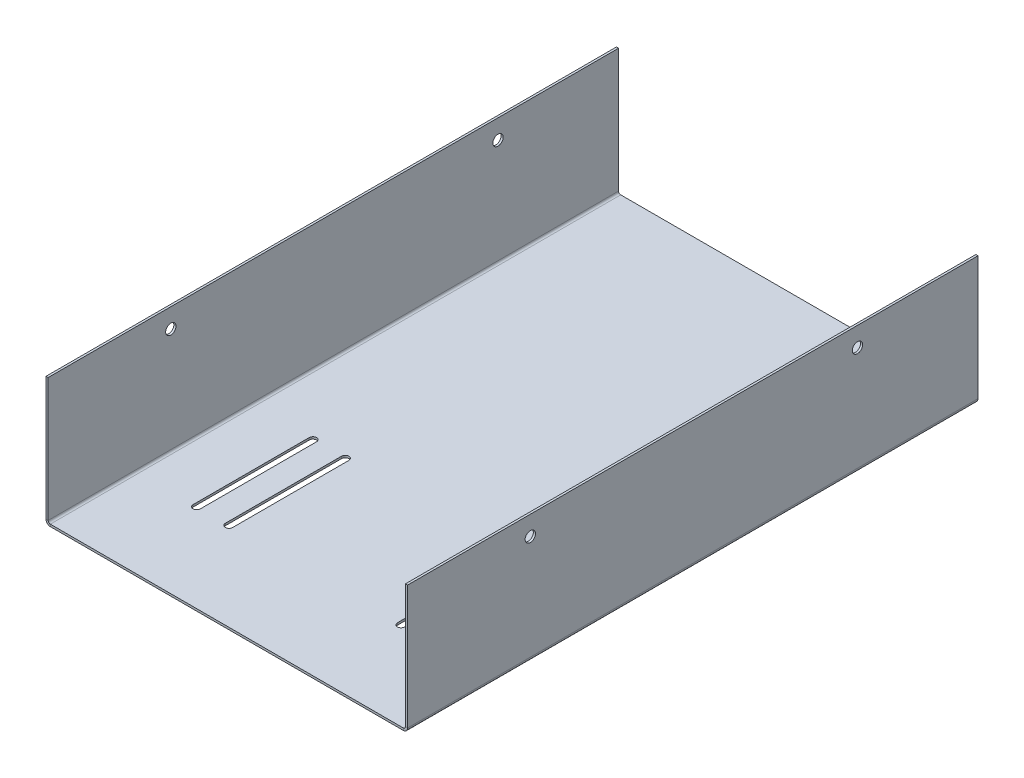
ISO-10303-21;
HEADER;
FILE_DESCRIPTION(('STEP AP214'),'2;1');
FILE_NAME('part.step','',(''),(''),'','','');
FILE_SCHEMA(('AUTOMOTIVE_DESIGN { 1 0 10303 214 1 1 1 1 }'));
ENDSEC;
DATA;
#1=APPLICATION_CONTEXT('core data for automotive mechanical design processes');
#2=APPLICATION_PROTOCOL_DEFINITION('international standard','automotive_design',2000,#1);
#3=PRODUCT_CONTEXT('',#1,'mechanical');
#4=PRODUCT('Part','Part','',(#3));
#5=PRODUCT_RELATED_PRODUCT_CATEGORY('part','',(#4));
#6=PRODUCT_DEFINITION_FORMATION('','',#4);
#7=PRODUCT_DEFINITION_CONTEXT('part definition',#1,'design');
#8=PRODUCT_DEFINITION('design','',#6,#7);
#9=PRODUCT_DEFINITION_SHAPE('','',#8);
#10=(LENGTH_UNIT() NAMED_UNIT(*) SI_UNIT(.MILLI.,.METRE.));
#11=(NAMED_UNIT(*) PLANE_ANGLE_UNIT() SI_UNIT($,.RADIAN.));
#12=(NAMED_UNIT(*) SI_UNIT($,.STERADIAN.) SOLID_ANGLE_UNIT());
#13=UNCERTAINTY_MEASURE_WITH_UNIT(LENGTH_MEASURE(1.E-05),#10,'distance_accuracy_value','');
#14=(GEOMETRIC_REPRESENTATION_CONTEXT(3) GLOBAL_UNCERTAINTY_ASSIGNED_CONTEXT((#13)) GLOBAL_UNIT_ASSIGNED_CONTEXT((#10,
#11,#12)) REPRESENTATION_CONTEXT('',''));
#15=CARTESIAN_POINT('',(0.,0.,0.));
#16=DIRECTION('',(0.,0.,1.));
#17=DIRECTION('',(1.,0.,0.));
#18=AXIS2_PLACEMENT_3D('',#15,#16,#17);
#19=CARTESIAN_POINT('',(0.,-1.,0.));
#20=DIRECTION('',(0.,1.,0.));
#21=DIRECTION('',(0.,0.,1.));
#22=AXIS2_PLACEMENT_3D('',#19,#20,#21);
#23=PLANE('',#22);
#24=DIRECTION('',(0.,0.,1.));
#25=VECTOR('',#24,1.);
#26=CARTESIAN_POINT('',(-56.7,-1.,88.4429426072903));
#27=LINE('',#26,#25);
#28=CARTESIAN_POINT('',(-56.7,-1.,34.4429426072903));
#29=VERTEX_POINT('',#28);
#30=CARTESIAN_POINT('',(-56.7,-1.,88.4429426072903));
#31=VERTEX_POINT('',#30);
#32=EDGE_CURVE('E380',#29,#31,#27,.T.);
#33=ORIENTED_EDGE('',*,*,#32,.T.);
#34=CARTESIAN_POINT('',(-55.,-1.,88.4429426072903));
#35=DIRECTION('',(0.,1.,0.));
#36=DIRECTION('',(0.,0.,1.));
#37=AXIS2_PLACEMENT_3D('',#34,#35,#36);
#38=CIRCLE('',#37,1.70000000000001);
#39=CARTESIAN_POINT('',(-53.3,-1.,88.4429426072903));
#40=VERTEX_POINT('',#39);
#41=EDGE_CURVE('E372',#31,#40,#38,.T.);
#42=ORIENTED_EDGE('',*,*,#41,.T.);
#43=DIRECTION('',(0.,0.,-1.));
#44=VECTOR('',#43,1.);
#45=CARTESIAN_POINT('',(-53.3,-1.,88.4429426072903));
#46=LINE('',#45,#44);
#47=CARTESIAN_POINT('',(-53.3,-1.,34.4429426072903));
#48=VERTEX_POINT('',#47);
#49=EDGE_CURVE('E375',#40,#48,#46,.T.);
#50=ORIENTED_EDGE('',*,*,#49,.T.);
#51=CARTESIAN_POINT('',(-55.,-1.,34.4429426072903));
#52=DIRECTION('',(0.,1.,0.));
#53=DIRECTION('',(0.,0.,1.));
#54=AXIS2_PLACEMENT_3D('',#51,#52,#53);
#55=CIRCLE('',#54,1.70000000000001);
#56=EDGE_CURVE('E64',#48,#29,#55,.T.);
#57=ORIENTED_EDGE('',*,*,#56,.T.);
#58=EDGE_LOOP('',(#33,#42,#50,#57));
#59=FACE_BOUND('',#58,.T.);
#60=DIRECTION('',(0.,0.,1.));
#61=VECTOR('',#60,1.);
#62=CARTESIAN_POINT('',(-41.7,-1.,88.4429426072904));
#63=LINE('',#62,#61);
#64=CARTESIAN_POINT('',(-41.7,-1.,34.4429426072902));
#65=VERTEX_POINT('',#64);
#66=CARTESIAN_POINT('',(-41.7,-1.,88.4429426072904));
#67=VERTEX_POINT('',#66);
#68=EDGE_CURVE('E412',#65,#67,#63,.T.);
#69=ORIENTED_EDGE('',*,*,#68,.T.);
#70=CARTESIAN_POINT('',(-40.,-1.,88.4429426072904));
#71=DIRECTION('',(0.,1.,0.));
#72=DIRECTION('',(0.,0.,1.));
#73=AXIS2_PLACEMENT_3D('',#70,#71,#72);
#74=CIRCLE('',#73,1.70000000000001);
#75=CARTESIAN_POINT('',(-38.3,-1.,88.4429426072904));
#76=VERTEX_POINT('',#75);
#77=EDGE_CURVE('E402',#67,#76,#74,.T.);
#78=ORIENTED_EDGE('',*,*,#77,.T.);
#79=DIRECTION('',(0.,0.,-1.));
#80=VECTOR('',#79,1.);
#81=CARTESIAN_POINT('',(-38.3,-1.,88.4429426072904));
#82=LINE('',#81,#80);
#83=CARTESIAN_POINT('',(-38.3,-1.,34.4429426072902));
#84=VERTEX_POINT('',#83);
#85=EDGE_CURVE('E405',#76,#84,#82,.T.);
#86=ORIENTED_EDGE('',*,*,#85,.T.);
#87=CARTESIAN_POINT('',(-40.,-1.,34.4429426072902));
#88=DIRECTION('',(0.,1.,0.));
#89=DIRECTION('',(0.,0.,1.));
#90=AXIS2_PLACEMENT_3D('',#87,#88,#89);
#91=CIRCLE('',#90,1.70000000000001);
#92=EDGE_CURVE('E409',#84,#65,#91,.T.);
#93=ORIENTED_EDGE('',*,*,#92,.T.);
#94=EDGE_LOOP('',(#69,#78,#86,#93));
#95=FACE_BOUND('',#94,.T.);
#96=DIRECTION('',(0.,0.,1.));
#97=VECTOR('',#96,1.);
#98=CARTESIAN_POINT('',(53.3,-1.,88.4429426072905));
#99=LINE('',#98,#97);
#100=CARTESIAN_POINT('',(53.3,-1.,34.44294260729));
#101=VERTEX_POINT('',#100);
#102=CARTESIAN_POINT('',(53.3,-1.,88.4429426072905));
#103=VERTEX_POINT('',#102);
#104=EDGE_CURVE('E444',#101,#103,#99,.T.);
#105=ORIENTED_EDGE('',*,*,#104,.T.);
#106=CARTESIAN_POINT('',(55.,-1.,88.4429426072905));
#107=DIRECTION('',(0.,1.,0.));
#108=DIRECTION('',(0.,0.,1.));
#109=AXIS2_PLACEMENT_3D('',#106,#107,#108);
#110=CIRCLE('',#109,1.70000000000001);
#111=CARTESIAN_POINT('',(56.7,-1.,88.4429426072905));
#112=VERTEX_POINT('',#111);
#113=EDGE_CURVE('E434',#103,#112,#110,.T.);
#114=ORIENTED_EDGE('',*,*,#113,.T.);
#115=DIRECTION('',(0.,0.,-1.));
#116=VECTOR('',#115,1.);
#117=CARTESIAN_POINT('',(56.7,-1.,88.4429426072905));
#118=LINE('',#117,#116);
#119=CARTESIAN_POINT('',(56.7,-1.,34.44294260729));
#120=VERTEX_POINT('',#119);
#121=EDGE_CURVE('E437',#112,#120,#118,.T.);
#122=ORIENTED_EDGE('',*,*,#121,.T.);
#123=CARTESIAN_POINT('',(55.,-1.,34.44294260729));
#124=DIRECTION('',(0.,1.,0.));
#125=DIRECTION('',(0.,0.,1.));
#126=AXIS2_PLACEMENT_3D('',#123,#124,#125);
#127=CIRCLE('',#126,1.70000000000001);
#128=EDGE_CURVE('E441',#120,#101,#127,.T.);
#129=ORIENTED_EDGE('',*,*,#128,.T.);
#130=EDGE_LOOP('',(#105,#114,#122,#129));
#131=FACE_BOUND('',#130,.T.);
#132=DIRECTION('',(0.,0.,1.));
#133=VECTOR('',#132,1.);
#134=CARTESIAN_POINT('',(38.3,-1.,88.4429426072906));
#135=LINE('',#134,#133);
#136=CARTESIAN_POINT('',(38.3,-1.,34.44294260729));
#137=VERTEX_POINT('',#136);
#138=CARTESIAN_POINT('',(38.3,-1.,88.4429426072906));
#139=VERTEX_POINT('',#138);
#140=EDGE_CURVE('E476',#137,#139,#135,.T.);
#141=ORIENTED_EDGE('',*,*,#140,.T.);
#142=CARTESIAN_POINT('',(40.,-1.,88.4429426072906));
#143=DIRECTION('',(0.,1.,0.));
#144=DIRECTION('',(0.,0.,1.));
#145=AXIS2_PLACEMENT_3D('',#142,#143,#144);
#146=CIRCLE('',#145,1.7);
#147=CARTESIAN_POINT('',(41.7,-1.,88.4429426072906));
#148=VERTEX_POINT('',#147);
#149=EDGE_CURVE('E466',#139,#148,#146,.T.);
#150=ORIENTED_EDGE('',*,*,#149,.T.);
#151=DIRECTION('',(0.,0.,-1.));
#152=VECTOR('',#151,1.);
#153=CARTESIAN_POINT('',(41.7,-1.,88.4429426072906));
#154=LINE('',#153,#152);
#155=CARTESIAN_POINT('',(41.7,-1.,34.44294260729));
#156=VERTEX_POINT('',#155);
#157=EDGE_CURVE('E469',#148,#156,#154,.T.);
#158=ORIENTED_EDGE('',*,*,#157,.T.);
#159=CARTESIAN_POINT('',(40.,-1.,34.44294260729));
#160=DIRECTION('',(0.,1.,0.));
#161=DIRECTION('',(0.,0.,1.));
#162=AXIS2_PLACEMENT_3D('',#159,#160,#161);
#163=CIRCLE('',#162,1.7);
#164=EDGE_CURVE('E473',#156,#137,#163,.T.);
#165=ORIENTED_EDGE('',*,*,#164,.T.);
#166=EDGE_LOOP('',(#141,#150,#158,#165));
#167=FACE_BOUND('',#166,.T.);
#168=DIRECTION('',(0.,0.,-1.));
#169=VECTOR('',#168,1.);
#170=CARTESIAN_POINT('',(82.,-1.00000000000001,-135.55705739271));
#171=LINE('',#170,#169);
#172=CARTESIAN_POINT('',(82.,-1.00000000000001,-135.55705739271));
#173=VERTEX_POINT('',#172);
#174=CARTESIAN_POINT('',(82.,-1.,129.44294260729));
#175=VERTEX_POINT('',#174);
#176=EDGE_CURVE('E234',#173,#175,#171,.F.);
#177=ORIENTED_EDGE('',*,*,#176,.T.);
#178=DIRECTION('',(1.,0.,0.));
#179=VECTOR('',#178,1.);
#180=CARTESIAN_POINT('',(-83.,-1.,129.44294260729));
#181=LINE('',#180,#179);
#182=CARTESIAN_POINT('',(-82.,-0.999999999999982,129.44294260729));
#183=VERTEX_POINT('',#182);
#184=EDGE_CURVE('E11',#183,#175,#181,.T.);
#185=ORIENTED_EDGE('',*,*,#184,.F.);
#186=DIRECTION('',(0.,0.,1.));
#187=VECTOR('',#186,1.);
#188=CARTESIAN_POINT('',(-82.,-0.999999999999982,129.44294260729));
#189=LINE('',#188,#187);
#190=CARTESIAN_POINT('',(-82.,-1.,-135.55705739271));
#191=VERTEX_POINT('',#190);
#192=EDGE_CURVE('E350',#183,#191,#189,.F.);
#193=ORIENTED_EDGE('',*,*,#192,.T.);
#194=DIRECTION('',(-1.,0.,0.));
#195=VECTOR('',#194,1.);
#196=CARTESIAN_POINT('',(-83.,-1.,-135.55705739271));
#197=LINE('',#196,#195);
#198=EDGE_CURVE('E48',#173,#191,#197,.T.);
#199=ORIENTED_EDGE('',*,*,#198,.F.);
#200=EDGE_LOOP('',(#177,#185,#193,#199));
#201=FACE_BOUND('',#200,.T.);
#202=ADVANCED_FACE('F39',(#59,#95,#131,#167,#201),#23,.F.);
#203=CARTESIAN_POINT('',(0.,0.,0.));
#204=DIRECTION('',(0.,1.,0.));
#205=DIRECTION('',(0.,0.,1.));
#206=AXIS2_PLACEMENT_3D('',#203,#204,#205);
#207=PLANE('',#206);
#208=CARTESIAN_POINT('',(-55.,0.,88.4429426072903));
#209=DIRECTION('',(0.,1.,0.));
#210=DIRECTION('',(0.,0.,1.));
#211=AXIS2_PLACEMENT_3D('',#208,#209,#210);
#212=CIRCLE('',#211,1.70000000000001);
#213=CARTESIAN_POINT('',(-56.7,0.,88.4429426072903));
#214=VERTEX_POINT('',#213);
#215=CARTESIAN_POINT('',(-53.3,0.,88.4429426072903));
#216=VERTEX_POINT('',#215);
#217=EDGE_CURVE('E369',#214,#216,#212,.T.);
#218=ORIENTED_EDGE('',*,*,#217,.F.);
#219=DIRECTION('',(0.,0.,1.));
#220=VECTOR('',#219,1.);
#221=CARTESIAN_POINT('',(-56.7,0.,88.4429426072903));
#222=LINE('',#221,#220);
#223=CARTESIAN_POINT('',(-56.7,0.,34.4429426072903));
#224=VERTEX_POINT('',#223);
#225=EDGE_CURVE('E376',#224,#214,#222,.T.);
#226=ORIENTED_EDGE('',*,*,#225,.F.);
#227=CARTESIAN_POINT('',(-55.,0.,34.4429426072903));
#228=DIRECTION('',(0.,1.,0.));
#229=DIRECTION('',(0.,0.,1.));
#230=AXIS2_PLACEMENT_3D('',#227,#228,#229);
#231=CIRCLE('',#230,1.70000000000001);
#232=CARTESIAN_POINT('',(-53.3,0.,34.4429426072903));
#233=VERTEX_POINT('',#232);
#234=EDGE_CURVE('E388',#233,#224,#231,.T.);
#235=ORIENTED_EDGE('',*,*,#234,.F.);
#236=DIRECTION('',(0.,0.,-1.));
#237=VECTOR('',#236,1.);
#238=CARTESIAN_POINT('',(-53.3,0.,88.4429426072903));
#239=LINE('',#238,#237);
#240=EDGE_CURVE('E385',#216,#233,#239,.T.);
#241=ORIENTED_EDGE('',*,*,#240,.F.);
#242=EDGE_LOOP('',(#218,#226,#235,#241));
#243=FACE_BOUND('',#242,.T.);
#244=CARTESIAN_POINT('',(-40.,0.,88.4429426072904));
#245=DIRECTION('',(0.,1.,0.));
#246=DIRECTION('',(0.,0.,1.));
#247=AXIS2_PLACEMENT_3D('',#244,#245,#246);
#248=CIRCLE('',#247,1.70000000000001);
#249=CARTESIAN_POINT('',(-41.7,0.,88.4429426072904));
#250=VERTEX_POINT('',#249);
#251=CARTESIAN_POINT('',(-38.3,0.,88.4429426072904));
#252=VERTEX_POINT('',#251);
#253=EDGE_CURVE('E395',#250,#252,#248,.T.);
#254=ORIENTED_EDGE('',*,*,#253,.F.);
#255=DIRECTION('',(0.,0.,1.));
#256=VECTOR('',#255,1.);
#257=CARTESIAN_POINT('',(-41.7,0.,88.4429426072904));
#258=LINE('',#257,#256);
#259=CARTESIAN_POINT('',(-41.7,0.,34.4429426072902));
#260=VERTEX_POINT('',#259);
#261=EDGE_CURVE('E406',#260,#250,#258,.T.);
#262=ORIENTED_EDGE('',*,*,#261,.F.);
#263=CARTESIAN_POINT('',(-40.,0.,34.4429426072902));
#264=DIRECTION('',(0.,1.,0.));
#265=DIRECTION('',(0.,0.,1.));
#266=AXIS2_PLACEMENT_3D('',#263,#264,#265);
#267=CIRCLE('',#266,1.70000000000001);
#268=CARTESIAN_POINT('',(-38.3,0.,34.4429426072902));
#269=VERTEX_POINT('',#268);
#270=EDGE_CURVE('E420',#269,#260,#267,.T.);
#271=ORIENTED_EDGE('',*,*,#270,.F.);
#272=DIRECTION('',(0.,0.,-1.));
#273=VECTOR('',#272,1.);
#274=CARTESIAN_POINT('',(-38.3,0.,88.4429426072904));
#275=LINE('',#274,#273);
#276=EDGE_CURVE('E417',#252,#269,#275,.T.);
#277=ORIENTED_EDGE('',*,*,#276,.F.);
#278=EDGE_LOOP('',(#254,#262,#271,#277));
#279=FACE_BOUND('',#278,.T.);
#280=CARTESIAN_POINT('',(55.,0.,88.4429426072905));
#281=DIRECTION('',(0.,1.,0.));
#282=DIRECTION('',(0.,0.,1.));
#283=AXIS2_PLACEMENT_3D('',#280,#281,#282);
#284=CIRCLE('',#283,1.70000000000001);
#285=CARTESIAN_POINT('',(53.3,0.,88.4429426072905));
#286=VERTEX_POINT('',#285);
#287=CARTESIAN_POINT('',(56.7,0.,88.4429426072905));
#288=VERTEX_POINT('',#287);
#289=EDGE_CURVE('E427',#286,#288,#284,.T.);
#290=ORIENTED_EDGE('',*,*,#289,.F.);
#291=DIRECTION('',(0.,0.,1.));
#292=VECTOR('',#291,1.);
#293=CARTESIAN_POINT('',(53.3,0.,88.4429426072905));
#294=LINE('',#293,#292);
#295=CARTESIAN_POINT('',(53.3,0.,34.44294260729));
#296=VERTEX_POINT('',#295);
#297=EDGE_CURVE('E438',#296,#286,#294,.T.);
#298=ORIENTED_EDGE('',*,*,#297,.F.);
#299=CARTESIAN_POINT('',(55.,0.,34.44294260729));
#300=DIRECTION('',(0.,1.,0.));
#301=DIRECTION('',(0.,0.,1.));
#302=AXIS2_PLACEMENT_3D('',#299,#300,#301);
#303=CIRCLE('',#302,1.70000000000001);
#304=CARTESIAN_POINT('',(56.7,0.,34.44294260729));
#305=VERTEX_POINT('',#304);
#306=EDGE_CURVE('E452',#305,#296,#303,.T.);
#307=ORIENTED_EDGE('',*,*,#306,.F.);
#308=DIRECTION('',(0.,0.,-1.));
#309=VECTOR('',#308,1.);
#310=CARTESIAN_POINT('',(56.7,0.,88.4429426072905));
#311=LINE('',#310,#309);
#312=EDGE_CURVE('E449',#288,#305,#311,.T.);
#313=ORIENTED_EDGE('',*,*,#312,.F.);
#314=EDGE_LOOP('',(#290,#298,#307,#313));
#315=FACE_BOUND('',#314,.T.);
#316=CARTESIAN_POINT('',(40.,0.,88.4429426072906));
#317=DIRECTION('',(0.,1.,0.));
#318=DIRECTION('',(0.,0.,1.));
#319=AXIS2_PLACEMENT_3D('',#316,#317,#318);
#320=CIRCLE('',#319,1.7);
#321=CARTESIAN_POINT('',(38.3,0.,88.4429426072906));
#322=VERTEX_POINT('',#321);
#323=CARTESIAN_POINT('',(41.7,0.,88.4429426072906));
#324=VERTEX_POINT('',#323);
#325=EDGE_CURVE('E459',#322,#324,#320,.T.);
#326=ORIENTED_EDGE('',*,*,#325,.F.);
#327=DIRECTION('',(0.,0.,1.));
#328=VECTOR('',#327,1.);
#329=CARTESIAN_POINT('',(38.3,0.,88.4429426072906));
#330=LINE('',#329,#328);
#331=CARTESIAN_POINT('',(38.3,0.,34.44294260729));
#332=VERTEX_POINT('',#331);
#333=EDGE_CURVE('E470',#332,#322,#330,.T.);
#334=ORIENTED_EDGE('',*,*,#333,.F.);
#335=CARTESIAN_POINT('',(40.,0.,34.44294260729));
#336=DIRECTION('',(0.,1.,0.));
#337=DIRECTION('',(0.,0.,1.));
#338=AXIS2_PLACEMENT_3D('',#335,#336,#337);
#339=CIRCLE('',#338,1.7);
#340=CARTESIAN_POINT('',(41.7,0.,34.44294260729));
#341=VERTEX_POINT('',#340);
#342=EDGE_CURVE('E484',#341,#332,#339,.T.);
#343=ORIENTED_EDGE('',*,*,#342,.F.);
#344=DIRECTION('',(0.,0.,-1.));
#345=VECTOR('',#344,1.);
#346=CARTESIAN_POINT('',(41.7,0.,88.4429426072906));
#347=LINE('',#346,#345);
#348=EDGE_CURVE('E481',#324,#341,#347,.T.);
#349=ORIENTED_EDGE('',*,*,#348,.F.);
#350=EDGE_LOOP('',(#326,#334,#343,#349));
#351=FACE_BOUND('',#350,.T.);
#352=DIRECTION('',(1.,0.,0.));
#353=VECTOR('',#352,1.);
#354=CARTESIAN_POINT('',(-83.,0.,129.44294260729));
#355=LINE('',#354,#353);
#356=CARTESIAN_POINT('',(-82.,0.,129.44294260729));
#357=VERTEX_POINT('',#356);
#358=CARTESIAN_POINT('',(82.,0.,129.44294260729));
#359=VERTEX_POINT('',#358);
#360=EDGE_CURVE('E43',#357,#359,#355,.T.);
#361=ORIENTED_EDGE('',*,*,#360,.T.);
#362=DIRECTION('',(0.,0.,-1.));
#363=VECTOR('',#362,1.);
#364=CARTESIAN_POINT('',(82.,0.,-135.55705739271));
#365=LINE('',#364,#363);
#366=CARTESIAN_POINT('',(82.,0.,-135.55705739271));
#367=VERTEX_POINT('',#366);
#368=EDGE_CURVE('E298',#367,#359,#365,.F.);
#369=ORIENTED_EDGE('',*,*,#368,.F.);
#370=DIRECTION('',(-1.,0.,0.));
#371=VECTOR('',#370,1.);
#372=CARTESIAN_POINT('',(-83.,0.,-135.55705739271));
#373=LINE('',#372,#371);
#374=CARTESIAN_POINT('',(-82.,0.,-135.55705739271));
#375=VERTEX_POINT('',#374);
#376=EDGE_CURVE('E491',#367,#375,#373,.T.);
#377=ORIENTED_EDGE('',*,*,#376,.T.);
#378=DIRECTION('',(0.,0.,1.));
#379=VECTOR('',#378,1.);
#380=CARTESIAN_POINT('',(-82.,0.,129.44294260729));
#381=LINE('',#380,#379);
#382=EDGE_CURVE('E56',#357,#375,#381,.F.);
#383=ORIENTED_EDGE('',*,*,#382,.F.);
#384=EDGE_LOOP('',(#361,#369,#377,#383));
#385=FACE_BOUND('',#384,.T.);
#386=ADVANCED_FACE('F500',(#243,#279,#315,#351,#385),#207,.T.);
#387=CARTESIAN_POINT('',(-83.,-1.,-135.55705739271));
#388=DIRECTION('',(0.,0.,-1.));
#389=DIRECTION('',(-1.,0.,0.));
#390=AXIS2_PLACEMENT_3D('',#387,#388,#389);
#391=PLANE('',#390);
#392=ORIENTED_EDGE('',*,*,#376,.F.);
#393=DIRECTION('',(0.,-1.,0.));
#394=VECTOR('',#393,1.);
#395=CARTESIAN_POINT('',(82.,0.,-135.55705739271));
#396=LINE('',#395,#394);
#397=EDGE_CURVE('E294',#367,#173,#396,.T.);
#398=ORIENTED_EDGE('',*,*,#397,.T.);
#399=ORIENTED_EDGE('',*,*,#198,.T.);
#400=DIRECTION('',(0.,-1.,0.));
#401=VECTOR('',#400,1.);
#402=CARTESIAN_POINT('',(-82.,0.,-135.55705739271));
#403=LINE('',#402,#401);
#404=EDGE_CURVE('E366',#375,#191,#403,.T.);
#405=ORIENTED_EDGE('',*,*,#404,.F.);
#406=EDGE_LOOP('',(#392,#398,#399,#405));
#407=FACE_BOUND('',#406,.T.);
#408=ADVANCED_FACE('F41',(#407),#391,.T.);
#409=CARTESIAN_POINT('',(-83.,-1.,129.44294260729));
#410=DIRECTION('',(0.,0.,1.));
#411=DIRECTION('',(1.,0.,0.));
#412=AXIS2_PLACEMENT_3D('',#409,#410,#411);
#413=PLANE('',#412);
#414=DIRECTION('',(0.,-1.,0.));
#415=VECTOR('',#414,1.);
#416=CARTESIAN_POINT('',(82.,0.,129.44294260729));
#417=LINE('',#416,#415);
#418=EDGE_CURVE('E302',#359,#175,#417,.T.);
#419=ORIENTED_EDGE('',*,*,#418,.F.);
#420=ORIENTED_EDGE('',*,*,#360,.F.);
#421=DIRECTION('',(0.,-1.,0.));
#422=VECTOR('',#421,1.);
#423=CARTESIAN_POINT('',(-82.,0.,129.44294260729));
#424=LINE('',#423,#422);
#425=EDGE_CURVE('E357',#357,#183,#424,.T.);
#426=ORIENTED_EDGE('',*,*,#425,.T.);
#427=ORIENTED_EDGE('',*,*,#184,.T.);
#428=EDGE_LOOP('',(#419,#420,#426,#427));
#429=FACE_BOUND('',#428,.T.);
#430=ADVANCED_FACE('F544',(#429),#413,.T.);
#431=CARTESIAN_POINT('',(40.,-1.,88.4429426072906));
#432=DIRECTION('',(0.,1.,0.));
#433=DIRECTION('',(0.,0.,1.));
#434=AXIS2_PLACEMENT_3D('',#431,#432,#433);
#435=CYLINDRICAL_SURFACE('',#434,1.7);
#436=ORIENTED_EDGE('',*,*,#325,.T.);
#437=DIRECTION('',(0.,1.,0.));
#438=VECTOR('',#437,1.);
#439=CARTESIAN_POINT('',(41.7,-1.,88.4429426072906));
#440=LINE('',#439,#438);
#441=EDGE_CURVE('E479',#148,#324,#440,.T.);
#442=ORIENTED_EDGE('',*,*,#441,.F.);
#443=ORIENTED_EDGE('',*,*,#149,.F.);
#444=DIRECTION('',(0.,1.,0.));
#445=VECTOR('',#444,1.);
#446=CARTESIAN_POINT('',(38.3,-1.,88.4429426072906));
#447=LINE('',#446,#445);
#448=EDGE_CURVE('E489',#139,#322,#447,.T.);
#449=ORIENTED_EDGE('',*,*,#448,.T.);
#450=EDGE_LOOP('',(#436,#442,#443,#449));
#451=FACE_BOUND('',#450,.T.);
#452=ADVANCED_FACE('F542',(#451),#435,.F.);
#453=CARTESIAN_POINT('',(38.3,-1.,88.4429426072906));
#454=DIRECTION('',(-1.,0.,0.));
#455=DIRECTION('',(0.,0.,1.));
#456=AXIS2_PLACEMENT_3D('',#453,#454,#455);
#457=PLANE('',#456);
#458=ORIENTED_EDGE('',*,*,#333,.T.);
#459=ORIENTED_EDGE('',*,*,#448,.F.);
#460=ORIENTED_EDGE('',*,*,#140,.F.);
#461=DIRECTION('',(0.,1.,0.));
#462=VECTOR('',#461,1.);
#463=CARTESIAN_POINT('',(38.3,-1.,34.44294260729));
#464=LINE('',#463,#462);
#465=EDGE_CURVE('E492',#137,#332,#464,.T.);
#466=ORIENTED_EDGE('',*,*,#465,.T.);
#467=EDGE_LOOP('',(#458,#459,#460,#466));
#468=FACE_BOUND('',#467,.T.);
#469=ADVANCED_FACE('F550',(#468),#457,.F.);
#470=CARTESIAN_POINT('',(40.,-1.,34.44294260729));
#471=DIRECTION('',(0.,1.,0.));
#472=DIRECTION('',(0.,0.,1.));
#473=AXIS2_PLACEMENT_3D('',#470,#471,#472);
#474=CYLINDRICAL_SURFACE('',#473,1.7);
#475=ORIENTED_EDGE('',*,*,#342,.T.);
#476=ORIENTED_EDGE('',*,*,#465,.F.);
#477=ORIENTED_EDGE('',*,*,#164,.F.);
#478=DIRECTION('',(0.,1.,0.));
#479=VECTOR('',#478,1.);
#480=CARTESIAN_POINT('',(41.7,-1.,34.44294260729));
#481=LINE('',#480,#479);
#482=EDGE_CURVE('E494',#156,#341,#481,.T.);
#483=ORIENTED_EDGE('',*,*,#482,.T.);
#484=EDGE_LOOP('',(#475,#476,#477,#483));
#485=FACE_BOUND('',#484,.T.);
#486=ADVANCED_FACE('F656',(#485),#474,.F.);
#487=CARTESIAN_POINT('',(41.7,-1.,88.4429426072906));
#488=DIRECTION('',(1.,0.,0.));
#489=DIRECTION('',(0.,0.,-1.));
#490=AXIS2_PLACEMENT_3D('',#487,#488,#489);
#491=PLANE('',#490);
#492=ORIENTED_EDGE('',*,*,#348,.T.);
#493=ORIENTED_EDGE('',*,*,#482,.F.);
#494=ORIENTED_EDGE('',*,*,#157,.F.);
#495=ORIENTED_EDGE('',*,*,#441,.T.);
#496=EDGE_LOOP('',(#492,#493,#494,#495));
#497=FACE_BOUND('',#496,.T.);
#498=ADVANCED_FACE('F652',(#497),#491,.F.);
#499=CARTESIAN_POINT('',(55.,-1.,88.4429426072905));
#500=DIRECTION('',(0.,1.,0.));
#501=DIRECTION('',(0.,0.,1.));
#502=AXIS2_PLACEMENT_3D('',#499,#500,#501);
#503=CYLINDRICAL_SURFACE('',#502,1.70000000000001);
#504=ORIENTED_EDGE('',*,*,#289,.T.);
#505=DIRECTION('',(0.,1.,0.));
#506=VECTOR('',#505,1.);
#507=CARTESIAN_POINT('',(56.7,-1.,88.4429426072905));
#508=LINE('',#507,#506);
#509=EDGE_CURVE('E447',#112,#288,#508,.T.);
#510=ORIENTED_EDGE('',*,*,#509,.F.);
#511=ORIENTED_EDGE('',*,*,#113,.F.);
#512=DIRECTION('',(0.,1.,0.));
#513=VECTOR('',#512,1.);
#514=CARTESIAN_POINT('',(53.3,-1.,88.4429426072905));
#515=LINE('',#514,#513);
#516=EDGE_CURVE('E457',#103,#286,#515,.T.);
#517=ORIENTED_EDGE('',*,*,#516,.T.);
#518=EDGE_LOOP('',(#504,#510,#511,#517));
#519=FACE_BOUND('',#518,.T.);
#520=ADVANCED_FACE('F642',(#519),#503,.F.);
#521=CARTESIAN_POINT('',(53.3,-1.,88.4429426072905));
#522=DIRECTION('',(-1.,0.,0.));
#523=DIRECTION('',(0.,0.,1.));
#524=AXIS2_PLACEMENT_3D('',#521,#522,#523);
#525=PLANE('',#524);
#526=ORIENTED_EDGE('',*,*,#297,.T.);
#527=ORIENTED_EDGE('',*,*,#516,.F.);
#528=ORIENTED_EDGE('',*,*,#104,.F.);
#529=DIRECTION('',(0.,1.,0.));
#530=VECTOR('',#529,1.);
#531=CARTESIAN_POINT('',(53.3,-1.,34.44294260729));
#532=LINE('',#531,#530);
#533=EDGE_CURVE('E460',#101,#296,#532,.T.);
#534=ORIENTED_EDGE('',*,*,#533,.T.);
#535=EDGE_LOOP('',(#526,#527,#528,#534));
#536=FACE_BOUND('',#535,.T.);
#537=ADVANCED_FACE('F638',(#536),#525,.F.);
#538=CARTESIAN_POINT('',(55.,-1.,34.44294260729));
#539=DIRECTION('',(0.,1.,0.));
#540=DIRECTION('',(0.,0.,1.));
#541=AXIS2_PLACEMENT_3D('',#538,#539,#540);
#542=CYLINDRICAL_SURFACE('',#541,1.70000000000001);
#543=ORIENTED_EDGE('',*,*,#306,.T.);
#544=ORIENTED_EDGE('',*,*,#533,.F.);
#545=ORIENTED_EDGE('',*,*,#128,.F.);
#546=DIRECTION('',(0.,1.,0.));
#547=VECTOR('',#546,1.);
#548=CARTESIAN_POINT('',(56.7,-1.,34.44294260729));
#549=LINE('',#548,#547);
#550=EDGE_CURVE('E462',#120,#305,#549,.T.);
#551=ORIENTED_EDGE('',*,*,#550,.T.);
#552=EDGE_LOOP('',(#543,#544,#545,#551));
#553=FACE_BOUND('',#552,.T.);
#554=ADVANCED_FACE('F641',(#553),#542,.F.);
#555=CARTESIAN_POINT('',(56.7,-1.,88.4429426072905));
#556=DIRECTION('',(1.,0.,0.));
#557=DIRECTION('',(0.,0.,-1.));
#558=AXIS2_PLACEMENT_3D('',#555,#556,#557);
#559=PLANE('',#558);
#560=ORIENTED_EDGE('',*,*,#312,.T.);
#561=ORIENTED_EDGE('',*,*,#550,.F.);
#562=ORIENTED_EDGE('',*,*,#121,.F.);
#563=ORIENTED_EDGE('',*,*,#509,.T.);
#564=EDGE_LOOP('',(#560,#561,#562,#563));
#565=FACE_BOUND('',#564,.T.);
#566=ADVANCED_FACE('F636',(#565),#559,.F.);
#567=CARTESIAN_POINT('',(-40.,-1.,88.4429426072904));
#568=DIRECTION('',(0.,1.,0.));
#569=DIRECTION('',(0.,0.,1.));
#570=AXIS2_PLACEMENT_3D('',#567,#568,#569);
#571=CYLINDRICAL_SURFACE('',#570,1.70000000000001);
#572=ORIENTED_EDGE('',*,*,#253,.T.);
#573=DIRECTION('',(0.,1.,0.));
#574=VECTOR('',#573,1.);
#575=CARTESIAN_POINT('',(-38.3,-1.,88.4429426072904));
#576=LINE('',#575,#574);
#577=EDGE_CURVE('E415',#76,#252,#576,.T.);
#578=ORIENTED_EDGE('',*,*,#577,.F.);
#579=ORIENTED_EDGE('',*,*,#77,.F.);
#580=DIRECTION('',(0.,1.,0.));
#581=VECTOR('',#580,1.);
#582=CARTESIAN_POINT('',(-41.7,-1.,88.4429426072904));
#583=LINE('',#582,#581);
#584=EDGE_CURVE('E425',#67,#250,#583,.T.);
#585=ORIENTED_EDGE('',*,*,#584,.T.);
#586=EDGE_LOOP('',(#572,#578,#579,#585));
#587=FACE_BOUND('',#586,.T.);
#588=ADVANCED_FACE('F626',(#587),#571,.F.);
#589=CARTESIAN_POINT('',(-41.7,-1.,88.4429426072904));
#590=DIRECTION('',(-1.,0.,0.));
#591=DIRECTION('',(0.,0.,1.));
#592=AXIS2_PLACEMENT_3D('',#589,#590,#591);
#593=PLANE('',#592);
#594=ORIENTED_EDGE('',*,*,#261,.T.);
#595=ORIENTED_EDGE('',*,*,#584,.F.);
#596=ORIENTED_EDGE('',*,*,#68,.F.);
#597=DIRECTION('',(0.,1.,0.));
#598=VECTOR('',#597,1.);
#599=CARTESIAN_POINT('',(-41.7,-1.,34.4429426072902));
#600=LINE('',#599,#598);
#601=EDGE_CURVE('E428',#65,#260,#600,.T.);
#602=ORIENTED_EDGE('',*,*,#601,.T.);
#603=EDGE_LOOP('',(#594,#595,#596,#602));
#604=FACE_BOUND('',#603,.T.);
#605=ADVANCED_FACE('F622',(#604),#593,.F.);
#606=CARTESIAN_POINT('',(-40.,-1.,34.4429426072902));
#607=DIRECTION('',(0.,1.,0.));
#608=DIRECTION('',(0.,0.,1.));
#609=AXIS2_PLACEMENT_3D('',#606,#607,#608);
#610=CYLINDRICAL_SURFACE('',#609,1.70000000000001);
#611=ORIENTED_EDGE('',*,*,#270,.T.);
#612=ORIENTED_EDGE('',*,*,#601,.F.);
#613=ORIENTED_EDGE('',*,*,#92,.F.);
#614=DIRECTION('',(0.,1.,0.));
#615=VECTOR('',#614,1.);
#616=CARTESIAN_POINT('',(-38.3,-1.,34.4429426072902));
#617=LINE('',#616,#615);
#618=EDGE_CURVE('E430',#84,#269,#617,.T.);
#619=ORIENTED_EDGE('',*,*,#618,.T.);
#620=EDGE_LOOP('',(#611,#612,#613,#619));
#621=FACE_BOUND('',#620,.T.);
#622=ADVANCED_FACE('F625',(#621),#610,.F.);
#623=CARTESIAN_POINT('',(-38.3,-1.,88.4429426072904));
#624=DIRECTION('',(1.,0.,0.));
#625=DIRECTION('',(0.,0.,-1.));
#626=AXIS2_PLACEMENT_3D('',#623,#624,#625);
#627=PLANE('',#626);
#628=ORIENTED_EDGE('',*,*,#276,.T.);
#629=ORIENTED_EDGE('',*,*,#618,.F.);
#630=ORIENTED_EDGE('',*,*,#85,.F.);
#631=ORIENTED_EDGE('',*,*,#577,.T.);
#632=EDGE_LOOP('',(#628,#629,#630,#631));
#633=FACE_BOUND('',#632,.T.);
#634=ADVANCED_FACE('F620',(#633),#627,.F.);
#635=CARTESIAN_POINT('',(-55.,-1.,88.4429426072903));
#636=DIRECTION('',(0.,1.,0.));
#637=DIRECTION('',(0.,0.,1.));
#638=AXIS2_PLACEMENT_3D('',#635,#636,#637);
#639=CYLINDRICAL_SURFACE('',#638,1.70000000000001);
#640=ORIENTED_EDGE('',*,*,#217,.T.);
#641=DIRECTION('',(0.,1.,0.));
#642=VECTOR('',#641,1.);
#643=CARTESIAN_POINT('',(-53.3,-1.,88.4429426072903));
#644=LINE('',#643,#642);
#645=EDGE_CURVE('E383',#40,#216,#644,.T.);
#646=ORIENTED_EDGE('',*,*,#645,.F.);
#647=ORIENTED_EDGE('',*,*,#41,.F.);
#648=DIRECTION('',(0.,1.,0.));
#649=VECTOR('',#648,1.);
#650=CARTESIAN_POINT('',(-56.7,-1.,88.4429426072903));
#651=LINE('',#650,#649);
#652=EDGE_CURVE('E393',#31,#214,#651,.T.);
#653=ORIENTED_EDGE('',*,*,#652,.T.);
#654=EDGE_LOOP('',(#640,#646,#647,#653));
#655=FACE_BOUND('',#654,.T.);
#656=ADVANCED_FACE('F611',(#655),#639,.F.);
#657=CARTESIAN_POINT('',(-56.7,-1.,88.4429426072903));
#658=DIRECTION('',(-1.,0.,0.));
#659=DIRECTION('',(0.,0.,1.));
#660=AXIS2_PLACEMENT_3D('',#657,#658,#659);
#661=PLANE('',#660);
#662=ORIENTED_EDGE('',*,*,#225,.T.);
#663=ORIENTED_EDGE('',*,*,#652,.F.);
#664=ORIENTED_EDGE('',*,*,#32,.F.);
#665=DIRECTION('',(0.,1.,0.));
#666=VECTOR('',#665,1.);
#667=CARTESIAN_POINT('',(-56.7,-1.,34.4429426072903));
#668=LINE('',#667,#666);
#669=EDGE_CURVE('E396',#29,#224,#668,.T.);
#670=ORIENTED_EDGE('',*,*,#669,.T.);
#671=EDGE_LOOP('',(#662,#663,#664,#670));
#672=FACE_BOUND('',#671,.T.);
#673=ADVANCED_FACE('F607',(#672),#661,.F.);
#674=CARTESIAN_POINT('',(-55.,-1.,34.4429426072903));
#675=DIRECTION('',(0.,1.,0.));
#676=DIRECTION('',(0.,0.,1.));
#677=AXIS2_PLACEMENT_3D('',#674,#675,#676);
#678=CYLINDRICAL_SURFACE('',#677,1.70000000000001);
#679=ORIENTED_EDGE('',*,*,#234,.T.);
#680=ORIENTED_EDGE('',*,*,#669,.F.);
#681=ORIENTED_EDGE('',*,*,#56,.F.);
#682=DIRECTION('',(0.,1.,0.));
#683=VECTOR('',#682,1.);
#684=CARTESIAN_POINT('',(-53.3,-1.,34.4429426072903));
#685=LINE('',#684,#683);
#686=EDGE_CURVE('E398',#48,#233,#685,.T.);
#687=ORIENTED_EDGE('',*,*,#686,.T.);
#688=EDGE_LOOP('',(#679,#680,#681,#687));
#689=FACE_BOUND('',#688,.T.);
#690=ADVANCED_FACE('F610',(#689),#678,.F.);
#691=CARTESIAN_POINT('',(-53.3,-1.,88.4429426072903));
#692=DIRECTION('',(1.,0.,0.));
#693=DIRECTION('',(0.,0.,-1.));
#694=AXIS2_PLACEMENT_3D('',#691,#692,#693);
#695=PLANE('',#694);
#696=ORIENTED_EDGE('',*,*,#240,.T.);
#697=ORIENTED_EDGE('',*,*,#686,.F.);
#698=ORIENTED_EDGE('',*,*,#49,.F.);
#699=ORIENTED_EDGE('',*,*,#645,.T.);
#700=EDGE_LOOP('',(#696,#697,#698,#699));
#701=FACE_BOUND('',#700,.T.);
#702=ADVANCED_FACE('F604',(#701),#695,.F.);
#703=CARTESIAN_POINT('',(-82.,1.,-135.55705739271));
#704=DIRECTION('',(0.,0.,-1.));
#705=DIRECTION('',(0.,1.,0.));
#706=AXIS2_PLACEMENT_3D('',#703,#704,#705);
#707=PLANE('',#706);
#708=DIRECTION('',(-1.,0.,0.));
#709=VECTOR('',#708,1.);
#710=CARTESIAN_POINT('',(-83.,1.,-135.55705739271));
#711=LINE('',#710,#709);
#712=CARTESIAN_POINT('',(-83.,1.,-135.55705739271));
#713=VERTEX_POINT('',#712);
#714=CARTESIAN_POINT('',(-84.,0.999999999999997,-135.55705739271));
#715=VERTEX_POINT('',#714);
#716=EDGE_CURVE('E305',#713,#715,#711,.T.);
#717=ORIENTED_EDGE('',*,*,#716,.F.);
#718=CARTESIAN_POINT('',(-82.,1.,-135.55705739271));
#719=DIRECTION('',(0.,0.,1.));
#720=DIRECTION('',(0.,-1.,0.));
#721=AXIS2_PLACEMENT_3D('',#718,#719,#720);
#722=CIRCLE('',#721,1.00000000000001);
#723=EDGE_CURVE('E360',#375,#713,#722,.F.);
#724=ORIENTED_EDGE('',*,*,#723,.F.);
#725=ORIENTED_EDGE('',*,*,#404,.T.);
#726=CARTESIAN_POINT('',(-82.,1.,-135.55705739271));
#727=DIRECTION('',(0.,0.,1.));
#728=DIRECTION('',(0.,-1.,0.));
#729=AXIS2_PLACEMENT_3D('',#726,#727,#728);
#730=CIRCLE('',#729,2.00000000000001);
#731=EDGE_CURVE('E353',#191,#715,#730,.F.);
#732=ORIENTED_EDGE('',*,*,#731,.T.);
#733=EDGE_LOOP('',(#717,#724,#725,#732));
#734=FACE_BOUND('',#733,.T.);
#735=ADVANCED_FACE('F562',(#734),#707,.T.);
#736=CARTESIAN_POINT('',(-82.,1.00000000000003,129.44294260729));
#737=DIRECTION('',(0.,0.,-1.));
#738=DIRECTION('',(0.,1.,0.));
#739=AXIS2_PLACEMENT_3D('',#736,#737,#738);
#740=PLANE('',#739);
#741=CARTESIAN_POINT('',(-82.,1.00000000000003,129.44294260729));
#742=DIRECTION('',(0.,0.,1.));
#743=DIRECTION('',(0.,-1.,0.));
#744=AXIS2_PLACEMENT_3D('',#741,#742,#743);
#745=CIRCLE('',#744,1.00000000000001);
#746=CARTESIAN_POINT('',(-83.,1.00000000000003,129.44294260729));
#747=VERTEX_POINT('',#746);
#748=EDGE_CURVE('E349',#747,#357,#745,.T.);
#749=ORIENTED_EDGE('',*,*,#748,.F.);
#750=DIRECTION('',(-1.,0.,0.));
#751=VECTOR('',#750,1.);
#752=CARTESIAN_POINT('',(-83.,1.00000000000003,129.44294260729));
#753=LINE('',#752,#751);
#754=CARTESIAN_POINT('',(-84.0000000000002,1.00000000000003,129.44294260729));
#755=VERTEX_POINT('',#754);
#756=EDGE_CURVE('E310',#747,#755,#753,.T.);
#757=ORIENTED_EDGE('',*,*,#756,.T.);
#758=CARTESIAN_POINT('',(-82.,1.00000000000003,129.44294260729));
#759=DIRECTION('',(0.,0.,1.));
#760=DIRECTION('',(0.,-1.,0.));
#761=AXIS2_PLACEMENT_3D('',#758,#759,#760);
#762=CIRCLE('',#761,2.00000000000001);
#763=EDGE_CURVE('E354',#755,#183,#762,.T.);
#764=ORIENTED_EDGE('',*,*,#763,.T.);
#765=ORIENTED_EDGE('',*,*,#425,.F.);
#766=EDGE_LOOP('',(#749,#757,#764,#765));
#767=FACE_BOUND('',#766,.T.);
#768=ADVANCED_FACE('F582',(#767),#740,.F.);
#769=CARTESIAN_POINT('',(-82.,1.00000000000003,129.44294260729));
#770=DIRECTION('',(0.,0.,1.));
#771=DIRECTION('',(-1.,0.,0.));
#772=AXIS2_PLACEMENT_3D('',#769,#770,#771);
#773=CYLINDRICAL_SURFACE('',#772,2.00000000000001);
#774=ORIENTED_EDGE('',*,*,#192,.F.);
#775=ORIENTED_EDGE('',*,*,#763,.F.);
#776=DIRECTION('',(0.,0.,-1.));
#777=VECTOR('',#776,1.);
#778=CARTESIAN_POINT('',(-84.,1.00000000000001,0.));
#779=LINE('',#778,#777);
#780=EDGE_CURVE('E313',#755,#715,#779,.T.);
#781=ORIENTED_EDGE('',*,*,#780,.T.);
#782=ORIENTED_EDGE('',*,*,#731,.F.);
#783=EDGE_LOOP('',(#774,#775,#781,#782));
#784=FACE_BOUND('',#783,.T.);
#785=ADVANCED_FACE('F596',(#784),#773,.T.);
#786=CARTESIAN_POINT('',(-82.,1.00000000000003,129.44294260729));
#787=DIRECTION('',(0.,0.,1.));
#788=DIRECTION('',(-1.,0.,0.));
#789=AXIS2_PLACEMENT_3D('',#786,#787,#788);
#790=CYLINDRICAL_SURFACE('',#789,1.00000000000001);
#791=ORIENTED_EDGE('',*,*,#382,.T.);
#792=ORIENTED_EDGE('',*,*,#723,.T.);
#793=DIRECTION('',(0.,0.,1.));
#794=VECTOR('',#793,1.);
#795=CARTESIAN_POINT('',(-83.,1.,-135.55705739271));
#796=LINE('',#795,#794);
#797=EDGE_CURVE('E308',#713,#747,#796,.T.);
#798=ORIENTED_EDGE('',*,*,#797,.T.);
#799=ORIENTED_EDGE('',*,*,#748,.T.);
#800=EDGE_LOOP('',(#791,#792,#798,#799));
#801=FACE_BOUND('',#800,.T.);
#802=ADVANCED_FACE('F559',(#801),#790,.F.);
#803=CARTESIAN_POINT('',(-84.,-2.98839273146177E-13,0.));
#804=DIRECTION('',(1.,0.,0.));
#805=DIRECTION('',(0.,1.,0.));
#806=AXIS2_PLACEMENT_3D('',#803,#804,#805);
#807=PLANE('',#806);
#808=CARTESIAN_POINT('',(-84.0000000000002,49.500000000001,-79.5570573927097));
#809=DIRECTION('',(-1.,0.,0.));
#810=DIRECTION('',(0.,-1.,0.));
#811=AXIS2_PLACEMENT_3D('',#808,#809,#810);
#812=CIRCLE('',#811,2.4);
#813=CARTESIAN_POINT('',(-84.0000000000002,47.100000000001,-79.5570573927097));
#814=VERTEX_POINT('',#813);
#815=EDGE_CURVE('E318',#814,#814,#812,.T.);
#816=ORIENTED_EDGE('',*,*,#815,.F.);
#817=EDGE_LOOP('',(#816));
#818=FACE_BOUND('',#817,.T.);
#819=CARTESIAN_POINT('',(-84.0000000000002,49.500000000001,72.4429426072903));
#820=DIRECTION('',(-1.,0.,0.));
#821=DIRECTION('',(0.,-1.,0.));
#822=AXIS2_PLACEMENT_3D('',#819,#820,#821);
#823=CIRCLE('',#822,2.4);
#824=CARTESIAN_POINT('',(-84.0000000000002,47.100000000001,72.4429426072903));
#825=VERTEX_POINT('',#824);
#826=EDGE_CURVE('E324',#825,#825,#823,.T.);
#827=ORIENTED_EDGE('',*,*,#826,.F.);
#828=EDGE_LOOP('',(#827));
#829=FACE_BOUND('',#828,.T.);
#830=ORIENTED_EDGE('',*,*,#780,.F.);
#831=DIRECTION('',(0.,1.,0.));
#832=VECTOR('',#831,1.);
#833=CARTESIAN_POINT('',(-84.0000000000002,58.5,129.44294260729));
#834=LINE('',#833,#832);
#835=CARTESIAN_POINT('',(-84.0000000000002,58.5,129.44294260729));
#836=VERTEX_POINT('',#835);
#837=EDGE_CURVE('E333',#755,#836,#834,.T.);
#838=ORIENTED_EDGE('',*,*,#837,.T.);
#839=DIRECTION('',(0.,0.,-1.));
#840=VECTOR('',#839,1.);
#841=CARTESIAN_POINT('',(-84.0000000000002,58.5,-135.55705739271));
#842=LINE('',#841,#840);
#843=CARTESIAN_POINT('',(-84.0000000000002,58.5,-135.55705739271));
#844=VERTEX_POINT('',#843);
#845=EDGE_CURVE('E336',#836,#844,#842,.T.);
#846=ORIENTED_EDGE('',*,*,#845,.T.);
#847=DIRECTION('',(0.,-1.,0.));
#848=VECTOR('',#847,1.);
#849=CARTESIAN_POINT('',(-84.,0.,-135.55705739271));
#850=LINE('',#849,#848);
#851=EDGE_CURVE('E330',#844,#715,#850,.T.);
#852=ORIENTED_EDGE('',*,*,#851,.T.);
#853=EDGE_LOOP('',(#830,#838,#846,#852));
#854=FACE_BOUND('',#853,.T.);
#855=ADVANCED_FACE('F569',(#818,#829,#854),#807,.F.);
#856=CARTESIAN_POINT('',(-83.,-2.95347791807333E-13,0.));
#857=DIRECTION('',(1.,0.,0.));
#858=DIRECTION('',(0.,1.,0.));
#859=AXIS2_PLACEMENT_3D('',#856,#857,#858);
#860=PLANE('',#859);
#861=CARTESIAN_POINT('',(-83.0000000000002,49.500000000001,72.4429426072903));
#862=DIRECTION('',(-1.,0.,0.));
#863=DIRECTION('',(0.,-1.,0.));
#864=AXIS2_PLACEMENT_3D('',#861,#862,#863);
#865=CIRCLE('',#864,2.4);
#866=CARTESIAN_POINT('',(-83.0000000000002,47.100000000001,72.4429426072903));
#867=VERTEX_POINT('',#866);
#868=EDGE_CURVE('E321',#867,#867,#865,.T.);
#869=ORIENTED_EDGE('',*,*,#868,.T.);
#870=EDGE_LOOP('',(#869));
#871=FACE_BOUND('',#870,.T.);
#872=CARTESIAN_POINT('',(-83.0000000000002,49.500000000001,-79.5570573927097));
#873=DIRECTION('',(-1.,0.,0.));
#874=DIRECTION('',(0.,-1.,0.));
#875=AXIS2_PLACEMENT_3D('',#872,#873,#874);
#876=CIRCLE('',#875,2.4);
#877=CARTESIAN_POINT('',(-83.0000000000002,47.100000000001,-79.5570573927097));
#878=VERTEX_POINT('',#877);
#879=EDGE_CURVE('E317',#878,#878,#876,.T.);
#880=ORIENTED_EDGE('',*,*,#879,.T.);
#881=EDGE_LOOP('',(#880));
#882=FACE_BOUND('',#881,.T.);
#883=DIRECTION('',(0.,1.,0.));
#884=VECTOR('',#883,1.);
#885=CARTESIAN_POINT('',(-83.0000000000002,58.5,129.44294260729));
#886=LINE('',#885,#884);
#887=CARTESIAN_POINT('',(-83.0000000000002,58.5,129.44294260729));
#888=VERTEX_POINT('',#887);
#889=EDGE_CURVE('E341',#747,#888,#886,.T.);
#890=ORIENTED_EDGE('',*,*,#889,.F.);
#891=ORIENTED_EDGE('',*,*,#797,.F.);
#892=DIRECTION('',(0.,-1.,0.));
#893=VECTOR('',#892,1.);
#894=CARTESIAN_POINT('',(-83.,0.,-135.55705739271));
#895=LINE('',#894,#893);
#896=CARTESIAN_POINT('',(-83.0000000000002,58.5,-135.55705739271));
#897=VERTEX_POINT('',#896);
#898=EDGE_CURVE('E327',#897,#713,#895,.T.);
#899=ORIENTED_EDGE('',*,*,#898,.F.);
#900=DIRECTION('',(0.,0.,-1.));
#901=VECTOR('',#900,1.);
#902=CARTESIAN_POINT('',(-83.0000000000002,58.5,-135.55705739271));
#903=LINE('',#902,#901);
#904=EDGE_CURVE('E334',#888,#897,#903,.T.);
#905=ORIENTED_EDGE('',*,*,#904,.F.);
#906=EDGE_LOOP('',(#890,#891,#899,#905));
#907=FACE_BOUND('',#906,.T.);
#908=ADVANCED_FACE('F579',(#871,#882,#907),#860,.T.);
#909=CARTESIAN_POINT('',(-84.,0.,-135.55705739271));
#910=DIRECTION('',(0.,0.,1.));
#911=DIRECTION('',(1.,0.,0.));
#912=AXIS2_PLACEMENT_3D('',#909,#910,#911);
#913=PLANE('',#912);
#914=ORIENTED_EDGE('',*,*,#716,.T.);
#915=ORIENTED_EDGE('',*,*,#851,.F.);
#916=DIRECTION('',(1.,0.,0.));
#917=VECTOR('',#916,1.);
#918=CARTESIAN_POINT('',(-84.0000000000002,58.5,-135.55705739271));
#919=LINE('',#918,#917);
#920=EDGE_CURVE('E338',#844,#897,#919,.T.);
#921=ORIENTED_EDGE('',*,*,#920,.T.);
#922=ORIENTED_EDGE('',*,*,#898,.T.);
#923=EDGE_LOOP('',(#914,#915,#921,#922));
#924=FACE_BOUND('',#923,.T.);
#925=ADVANCED_FACE('F565',(#924),#913,.F.);
#926=CARTESIAN_POINT('',(-84.0000000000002,58.5,129.44294260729));
#927=DIRECTION('',(0.,0.,-1.));
#928=DIRECTION('',(-1.,0.,0.));
#929=AXIS2_PLACEMENT_3D('',#926,#927,#928);
#930=PLANE('',#929);
#931=ORIENTED_EDGE('',*,*,#756,.F.);
#932=ORIENTED_EDGE('',*,*,#889,.T.);
#933=DIRECTION('',(1.,0.,0.));
#934=VECTOR('',#933,1.);
#935=CARTESIAN_POINT('',(-84.0000000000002,58.5,129.44294260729));
#936=LINE('',#935,#934);
#937=EDGE_CURVE('E346',#836,#888,#936,.T.);
#938=ORIENTED_EDGE('',*,*,#937,.F.);
#939=ORIENTED_EDGE('',*,*,#837,.F.);
#940=EDGE_LOOP('',(#931,#932,#938,#939));
#941=FACE_BOUND('',#940,.T.);
#942=ADVANCED_FACE('F584',(#941),#930,.F.);
#943=CARTESIAN_POINT('',(-84.0000000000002,58.5,-135.55705739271));
#944=DIRECTION('',(0.,-1.,0.));
#945=DIRECTION('',(1.,0.,0.));
#946=AXIS2_PLACEMENT_3D('',#943,#944,#945);
#947=PLANE('',#946);
#948=ORIENTED_EDGE('',*,*,#904,.T.);
#949=ORIENTED_EDGE('',*,*,#920,.F.);
#950=ORIENTED_EDGE('',*,*,#845,.F.);
#951=ORIENTED_EDGE('',*,*,#937,.T.);
#952=EDGE_LOOP('',(#948,#949,#950,#951));
#953=FACE_BOUND('',#952,.T.);
#954=ADVANCED_FACE('F575',(#953),#947,.F.);
#955=CARTESIAN_POINT('',(-84.0000000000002,49.500000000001,72.4429426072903));
#956=DIRECTION('',(1.,0.,0.));
#957=DIRECTION('',(0.,1.,0.));
#958=AXIS2_PLACEMENT_3D('',#955,#956,#957);
#959=CYLINDRICAL_SURFACE('',#958,2.4);
#960=ORIENTED_EDGE('',*,*,#826,.T.);
#961=EDGE_LOOP('',(#960));
#962=FACE_BOUND('',#961,.T.);
#963=ORIENTED_EDGE('',*,*,#868,.F.);
#964=EDGE_LOOP('',(#963));
#965=FACE_BOUND('',#964,.T.);
#966=ADVANCED_FACE('F591',(#962,#965),#959,.F.);
#967=CARTESIAN_POINT('',(-84.0000000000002,49.500000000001,-79.5570573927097));
#968=DIRECTION('',(1.,0.,0.));
#969=DIRECTION('',(0.,1.,0.));
#970=AXIS2_PLACEMENT_3D('',#967,#968,#969);
#971=CYLINDRICAL_SURFACE('',#970,2.4);
#972=ORIENTED_EDGE('',*,*,#815,.T.);
#973=EDGE_LOOP('',(#972));
#974=FACE_BOUND('',#973,.T.);
#975=ORIENTED_EDGE('',*,*,#879,.F.);
#976=EDGE_LOOP('',(#975));
#977=FACE_BOUND('',#976,.T.);
#978=ADVANCED_FACE('F780',(#974,#977),#971,.F.);
#979=CARTESIAN_POINT('',(82.,1.,129.44294260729));
#980=DIRECTION('',(0.,0.,1.));
#981=DIRECTION('',(1.,0.,0.));
#982=AXIS2_PLACEMENT_3D('',#979,#980,#981);
#983=PLANE('',#982);
#984=DIRECTION('',(1.,0.,0.));
#985=VECTOR('',#984,1.);
#986=CARTESIAN_POINT('',(83.,1.,129.44294260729));
#987=LINE('',#986,#985);
#988=CARTESIAN_POINT('',(83.,1.,129.44294260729));
#989=VERTEX_POINT('',#988);
#990=CARTESIAN_POINT('',(84.,0.999999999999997,129.44294260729));
#991=VERTEX_POINT('',#990);
#992=EDGE_CURVE('E270',#989,#991,#987,.T.);
#993=ORIENTED_EDGE('',*,*,#992,.F.);
#994=CARTESIAN_POINT('',(82.,1.,129.44294260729));
#995=DIRECTION('',(0.,0.,-1.));
#996=DIRECTION('',(-1.,0.,0.));
#997=AXIS2_PLACEMENT_3D('',#994,#995,#996);
#998=CIRCLE('',#997,1.00000000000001);
#999=EDGE_CURVE('E237',#359,#989,#998,.F.);
#1000=ORIENTED_EDGE('',*,*,#999,.F.);
#1001=ORIENTED_EDGE('',*,*,#418,.T.);
#1002=CARTESIAN_POINT('',(82.,1.,129.44294260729));
#1003=DIRECTION('',(0.,0.,-1.));
#1004=DIRECTION('',(-1.,0.,0.));
#1005=AXIS2_PLACEMENT_3D('',#1002,#1003,#1004);
#1006=CIRCLE('',#1005,2.00000000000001);
#1007=EDGE_CURVE('E293',#175,#991,#1006,.F.);
#1008=ORIENTED_EDGE('',*,*,#1007,.T.);
#1009=EDGE_LOOP('',(#993,#1000,#1001,#1008));
#1010=FACE_BOUND('',#1009,.T.);
#1011=ADVANCED_FACE('F508',(#1010),#983,.T.);
#1012=CARTESIAN_POINT('',(82.,1.,-135.55705739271));
#1013=DIRECTION('',(0.,0.,1.));
#1014=DIRECTION('',(1.,0.,0.));
#1015=AXIS2_PLACEMENT_3D('',#1012,#1013,#1014);
#1016=PLANE('',#1015);
#1017=CARTESIAN_POINT('',(82.,1.,-135.55705739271));
#1018=DIRECTION('',(0.,0.,-1.));
#1019=DIRECTION('',(-1.,0.,0.));
#1020=AXIS2_PLACEMENT_3D('',#1017,#1018,#1019);
#1021=CIRCLE('',#1020,1.00000000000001);
#1022=CARTESIAN_POINT('',(83.,1.,-135.55705739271));
#1023=VERTEX_POINT('',#1022);
#1024=EDGE_CURVE('E245',#1023,#367,#1021,.T.);
#1025=ORIENTED_EDGE('',*,*,#1024,.F.);
#1026=DIRECTION('',(1.,0.,0.));
#1027=VECTOR('',#1026,1.);
#1028=CARTESIAN_POINT('',(83.,1.,-135.55705739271));
#1029=LINE('',#1028,#1027);
#1030=CARTESIAN_POINT('',(84.0000000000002,0.999999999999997,-135.55705739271));
#1031=VERTEX_POINT('',#1030);
#1032=EDGE_CURVE('E241',#1023,#1031,#1029,.T.);
#1033=ORIENTED_EDGE('',*,*,#1032,.T.);
#1034=CARTESIAN_POINT('',(82.,1.,-135.55705739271));
#1035=DIRECTION('',(0.,0.,-1.));
#1036=DIRECTION('',(-1.,0.,0.));
#1037=AXIS2_PLACEMENT_3D('',#1034,#1035,#1036);
#1038=CIRCLE('',#1037,2.00000000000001);
#1039=EDGE_CURVE('E227',#1031,#173,#1038,.T.);
#1040=ORIENTED_EDGE('',*,*,#1039,.T.);
#1041=ORIENTED_EDGE('',*,*,#397,.F.);
#1042=EDGE_LOOP('',(#1025,#1033,#1040,#1041));
#1043=FACE_BOUND('',#1042,.T.);
#1044=ADVANCED_FACE('F243',(#1043),#1016,.F.);
#1045=CARTESIAN_POINT('',(82.,1.,-135.55705739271));
#1046=DIRECTION('',(0.,0.,-1.));
#1047=DIRECTION('',(1.,0.,0.));
#1048=AXIS2_PLACEMENT_3D('',#1045,#1046,#1047);
#1049=CYLINDRICAL_SURFACE('',#1048,2.00000000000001);
#1050=ORIENTED_EDGE('',*,*,#176,.F.);
#1051=ORIENTED_EDGE('',*,*,#1039,.F.);
#1052=DIRECTION('',(0.,0.,1.));
#1053=VECTOR('',#1052,1.);
#1054=CARTESIAN_POINT('',(84.,0.999999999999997,0.));
#1055=LINE('',#1054,#1053);
#1056=EDGE_CURVE('E232',#1031,#991,#1055,.T.);
#1057=ORIENTED_EDGE('',*,*,#1056,.T.);
#1058=ORIENTED_EDGE('',*,*,#1007,.F.);
#1059=EDGE_LOOP('',(#1050,#1051,#1057,#1058));
#1060=FACE_BOUND('',#1059,.T.);
#1061=ADVANCED_FACE('F229',(#1060),#1049,.T.);
#1062=CARTESIAN_POINT('',(82.,1.,-135.55705739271));
#1063=DIRECTION('',(0.,0.,-1.));
#1064=DIRECTION('',(1.,0.,0.));
#1065=AXIS2_PLACEMENT_3D('',#1062,#1063,#1064);
#1066=CYLINDRICAL_SURFACE('',#1065,1.00000000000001);
#1067=ORIENTED_EDGE('',*,*,#368,.T.);
#1068=ORIENTED_EDGE('',*,*,#999,.T.);
#1069=DIRECTION('',(0.,0.,-1.));
#1070=VECTOR('',#1069,1.);
#1071=CARTESIAN_POINT('',(83.,1.,129.44294260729));
#1072=LINE('',#1071,#1070);
#1073=EDGE_CURVE('E248',#989,#1023,#1072,.T.);
#1074=ORIENTED_EDGE('',*,*,#1073,.T.);
#1075=ORIENTED_EDGE('',*,*,#1024,.T.);
#1076=EDGE_LOOP('',(#1067,#1068,#1074,#1075));
#1077=FACE_BOUND('',#1076,.T.);
#1078=ADVANCED_FACE('F505',(#1077),#1066,.F.);
#1079=CARTESIAN_POINT('',(84.,-2.98839273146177E-13,0.));
#1080=DIRECTION('',(-1.,0.,0.));
#1081=DIRECTION('',(0.,-1.,0.));
#1082=AXIS2_PLACEMENT_3D('',#1079,#1080,#1081);
#1083=PLANE('',#1082);
#1084=CARTESIAN_POINT('',(84.0000000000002,49.5000000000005,-79.5570573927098));
#1085=DIRECTION('',(1.,0.,0.));
#1086=DIRECTION('',(0.,1.,0.));
#1087=AXIS2_PLACEMENT_3D('',#1084,#1085,#1086);
#1088=CIRCLE('',#1087,2.4);
#1089=CARTESIAN_POINT('',(84.0000000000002,51.9000000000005,-79.5570573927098));
#1090=VERTEX_POINT('',#1089);
#1091=EDGE_CURVE('E266',#1090,#1090,#1088,.T.);
#1092=ORIENTED_EDGE('',*,*,#1091,.F.);
#1093=EDGE_LOOP('',(#1092));
#1094=FACE_BOUND('',#1093,.T.);
#1095=CARTESIAN_POINT('',(84.0000000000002,49.5000000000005,72.4429426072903));
#1096=DIRECTION('',(1.,0.,0.));
#1097=DIRECTION('',(0.,1.,0.));
#1098=AXIS2_PLACEMENT_3D('',#1095,#1096,#1097);
#1099=CIRCLE('',#1098,2.4);
#1100=CARTESIAN_POINT('',(84.0000000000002,51.9000000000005,72.4429426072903));
#1101=VERTEX_POINT('',#1100);
#1102=EDGE_CURVE('E274',#1101,#1101,#1099,.T.);
#1103=ORIENTED_EDGE('',*,*,#1102,.F.);
#1104=EDGE_LOOP('',(#1103));
#1105=FACE_BOUND('',#1104,.T.);
#1106=ORIENTED_EDGE('',*,*,#1056,.F.);
#1107=DIRECTION('',(0.,1.,0.));
#1108=VECTOR('',#1107,1.);
#1109=CARTESIAN_POINT('',(84.0000000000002,58.5,-135.55705739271));
#1110=LINE('',#1109,#1108);
#1111=CARTESIAN_POINT('',(84.0000000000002,58.5,-135.55705739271));
#1112=VERTEX_POINT('',#1111);
#1113=EDGE_CURVE('E251',#1031,#1112,#1110,.T.);
#1114=ORIENTED_EDGE('',*,*,#1113,.T.);
#1115=DIRECTION('',(0.,0.,1.));
#1116=VECTOR('',#1115,1.);
#1117=CARTESIAN_POINT('',(84.0000000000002,58.5,129.44294260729));
#1118=LINE('',#1117,#1116);
#1119=CARTESIAN_POINT('',(84.0000000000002,58.5,129.44294260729));
#1120=VERTEX_POINT('',#1119);
#1121=EDGE_CURVE('E257',#1112,#1120,#1118,.T.);
#1122=ORIENTED_EDGE('',*,*,#1121,.T.);
#1123=DIRECTION('',(0.,-1.,0.));
#1124=VECTOR('',#1123,1.);
#1125=CARTESIAN_POINT('',(84.,0.,129.44294260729));
#1126=LINE('',#1125,#1124);
#1127=EDGE_CURVE('E258',#1120,#991,#1126,.T.);
#1128=ORIENTED_EDGE('',*,*,#1127,.T.);
#1129=EDGE_LOOP('',(#1106,#1114,#1122,#1128));
#1130=FACE_BOUND('',#1129,.T.);
#1131=ADVANCED_FACE('F261',(#1094,#1105,#1130),#1083,.F.);
#1132=CARTESIAN_POINT('',(83.,-2.95347791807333E-13,0.));
#1133=DIRECTION('',(-1.,0.,0.));
#1134=DIRECTION('',(0.,-1.,0.));
#1135=AXIS2_PLACEMENT_3D('',#1132,#1133,#1134);
#1136=PLANE('',#1135);
#1137=CARTESIAN_POINT('',(83.0000000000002,49.5000000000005,72.4429426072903));
#1138=DIRECTION('',(1.,0.,0.));
#1139=DIRECTION('',(0.,1.,0.));
#1140=AXIS2_PLACEMENT_3D('',#1137,#1138,#1139);
#1141=CIRCLE('',#1140,2.4);
#1142=CARTESIAN_POINT('',(83.0000000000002,51.9000000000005,72.4429426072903));
#1143=VERTEX_POINT('',#1142);
#1144=EDGE_CURVE('E272',#1143,#1143,#1141,.T.);
#1145=ORIENTED_EDGE('',*,*,#1144,.T.);
#1146=EDGE_LOOP('',(#1145));
#1147=FACE_BOUND('',#1146,.T.);
#1148=CARTESIAN_POINT('',(83.0000000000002,49.5000000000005,-79.5570573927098));
#1149=DIRECTION('',(1.,0.,0.));
#1150=DIRECTION('',(0.,1.,0.));
#1151=AXIS2_PLACEMENT_3D('',#1148,#1149,#1150);
#1152=CIRCLE('',#1151,2.4);
#1153=CARTESIAN_POINT('',(83.0000000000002,51.9000000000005,-79.5570573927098));
#1154=VERTEX_POINT('',#1153);
#1155=EDGE_CURVE('E263',#1154,#1154,#1152,.T.);
#1156=ORIENTED_EDGE('',*,*,#1155,.T.);
#1157=EDGE_LOOP('',(#1156));
#1158=FACE_BOUND('',#1157,.T.);
#1159=DIRECTION('',(0.,1.,0.));
#1160=VECTOR('',#1159,1.);
#1161=CARTESIAN_POINT('',(83.0000000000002,58.5,-135.55705739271));
#1162=LINE('',#1161,#1160);
#1163=CARTESIAN_POINT('',(83.0000000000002,58.5,-135.55705739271));
#1164=VERTEX_POINT('',#1163);
#1165=EDGE_CURVE('E286',#1023,#1164,#1162,.T.);
#1166=ORIENTED_EDGE('',*,*,#1165,.F.);
#1167=ORIENTED_EDGE('',*,*,#1073,.F.);
#1168=DIRECTION('',(0.,-1.,0.));
#1169=VECTOR('',#1168,1.);
#1170=CARTESIAN_POINT('',(83.,0.,129.44294260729));
#1171=LINE('',#1170,#1169);
#1172=CARTESIAN_POINT('',(83.0000000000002,58.5,129.44294260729));
#1173=VERTEX_POINT('',#1172);
#1174=EDGE_CURVE('E277',#1173,#989,#1171,.T.);
#1175=ORIENTED_EDGE('',*,*,#1174,.F.);
#1176=DIRECTION('',(0.,0.,1.));
#1177=VECTOR('',#1176,1.);
#1178=CARTESIAN_POINT('',(83.0000000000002,58.5,129.44294260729));
#1179=LINE('',#1178,#1177);
#1180=EDGE_CURVE('E280',#1164,#1173,#1179,.T.);
#1181=ORIENTED_EDGE('',*,*,#1180,.F.);
#1182=EDGE_LOOP('',(#1166,#1167,#1175,#1181));
#1183=FACE_BOUND('',#1182,.T.);
#1184=ADVANCED_FACE('F514',(#1147,#1158,#1183),#1136,.T.);
#1185=CARTESIAN_POINT('',(84.,0.,129.44294260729));
#1186=DIRECTION('',(0.,0.,-1.));
#1187=DIRECTION('',(0.,1.,0.));
#1188=AXIS2_PLACEMENT_3D('',#1185,#1186,#1187);
#1189=PLANE('',#1188);
#1190=ORIENTED_EDGE('',*,*,#992,.T.);
#1191=ORIENTED_EDGE('',*,*,#1127,.F.);
#1192=DIRECTION('',(-1.,0.,0.));
#1193=VECTOR('',#1192,1.);
#1194=CARTESIAN_POINT('',(84.0000000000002,58.5,129.44294260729));
#1195=LINE('',#1194,#1193);
#1196=EDGE_CURVE('E283',#1120,#1173,#1195,.T.);
#1197=ORIENTED_EDGE('',*,*,#1196,.T.);
#1198=ORIENTED_EDGE('',*,*,#1174,.T.);
#1199=EDGE_LOOP('',(#1190,#1191,#1197,#1198));
#1200=FACE_BOUND('',#1199,.T.);
#1201=ADVANCED_FACE('F516',(#1200),#1189,.F.);
#1202=CARTESIAN_POINT('',(84.0000000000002,58.5,-135.55705739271));
#1203=DIRECTION('',(0.,0.,1.));
#1204=DIRECTION('',(1.,0.,0.));
#1205=AXIS2_PLACEMENT_3D('',#1202,#1203,#1204);
#1206=PLANE('',#1205);
#1207=ORIENTED_EDGE('',*,*,#1032,.F.);
#1208=ORIENTED_EDGE('',*,*,#1165,.T.);
#1209=DIRECTION('',(-1.,0.,0.));
#1210=VECTOR('',#1209,1.);
#1211=CARTESIAN_POINT('',(84.0000000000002,58.5,-135.55705739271));
#1212=LINE('',#1211,#1210);
#1213=EDGE_CURVE('E254',#1112,#1164,#1212,.T.);
#1214=ORIENTED_EDGE('',*,*,#1213,.F.);
#1215=ORIENTED_EDGE('',*,*,#1113,.F.);
#1216=EDGE_LOOP('',(#1207,#1208,#1214,#1215));
#1217=FACE_BOUND('',#1216,.T.);
#1218=ADVANCED_FACE('F252',(#1217),#1206,.F.);
#1219=CARTESIAN_POINT('',(84.0000000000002,58.5,129.44294260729));
#1220=DIRECTION('',(0.,-1.,0.));
#1221=DIRECTION('',(1.,0.,0.));
#1222=AXIS2_PLACEMENT_3D('',#1219,#1220,#1221);
#1223=PLANE('',#1222);
#1224=ORIENTED_EDGE('',*,*,#1180,.T.);
#1225=ORIENTED_EDGE('',*,*,#1196,.F.);
#1226=ORIENTED_EDGE('',*,*,#1121,.F.);
#1227=ORIENTED_EDGE('',*,*,#1213,.T.);
#1228=EDGE_LOOP('',(#1224,#1225,#1226,#1227));
#1229=FACE_BOUND('',#1228,.T.);
#1230=ADVANCED_FACE('F519',(#1229),#1223,.F.);
#1231=CARTESIAN_POINT('',(84.0000000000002,49.5000000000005,72.4429426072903));
#1232=DIRECTION('',(-1.,0.,0.));
#1233=DIRECTION('',(0.,-1.,0.));
#1234=AXIS2_PLACEMENT_3D('',#1231,#1232,#1233);
#1235=CYLINDRICAL_SURFACE('',#1234,2.4);
#1236=ORIENTED_EDGE('',*,*,#1102,.T.);
#1237=EDGE_LOOP('',(#1236));
#1238=FACE_BOUND('',#1237,.T.);
#1239=ORIENTED_EDGE('',*,*,#1144,.F.);
#1240=EDGE_LOOP('',(#1239));
#1241=FACE_BOUND('',#1240,.T.);
#1242=ADVANCED_FACE('F521',(#1238,#1241),#1235,.F.);
#1243=CARTESIAN_POINT('',(84.0000000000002,49.5000000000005,-79.5570573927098));
#1244=DIRECTION('',(-1.,0.,0.));
#1245=DIRECTION('',(0.,-1.,0.));
#1246=AXIS2_PLACEMENT_3D('',#1243,#1244,#1245);
#1247=CYLINDRICAL_SURFACE('',#1246,2.4);
#1248=ORIENTED_EDGE('',*,*,#1091,.T.);
#1249=EDGE_LOOP('',(#1248));
#1250=FACE_BOUND('',#1249,.T.);
#1251=ORIENTED_EDGE('',*,*,#1155,.F.);
#1252=EDGE_LOOP('',(#1251));
#1253=FACE_BOUND('',#1252,.T.);
#1254=ADVANCED_FACE('F527',(#1250,#1253),#1247,.F.);
#1255=CLOSED_SHELL('',(#202,#386,#408,#430,#452,#469,#486,#498,#520,#537,#554,#566,#588,#605,
#622,#634,#656,#673,#690,#702,#735,#768,#785,#802,#855,#908,#925,#942,#954,#966,#978,#1011,
#1044,#1061,#1078,#1131,#1184,#1201,#1218,#1230,#1242,#1254));
#1256=MANIFOLD_SOLID_BREP('B2',#1255);
#1257=ADVANCED_BREP_SHAPE_REPRESENTATION('',(#18,#1256),#14);
#1258=SHAPE_DEFINITION_REPRESENTATION(#9,#1257);
ENDSEC;
END-ISO-10303-21;
